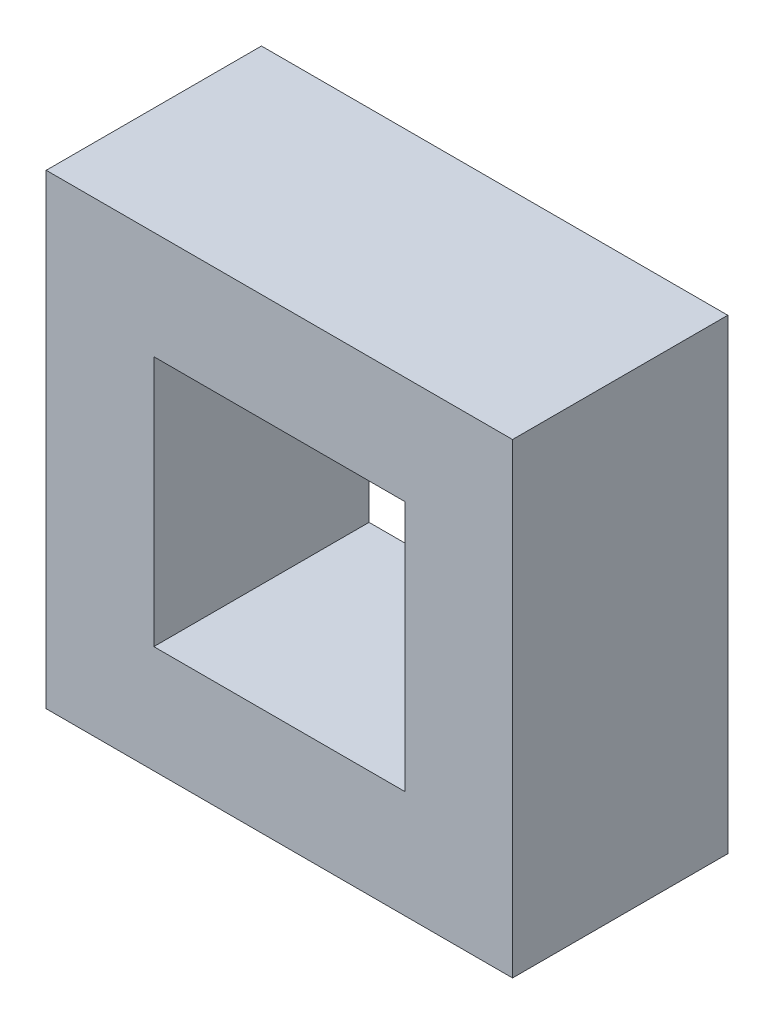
from build123d import *

# Parameters (mm, degrees)
SKETCH2_W      = 660.4
SKETCH2_H      = 660.4
SKETCH2_W_2    = 355.6
SKETCH2_H_2    = 355.6
EXTRUDE1_DEPTH = 304.8


with BuildPart() as part:
    # Sketch2 → Extrude1 (new body)
    with BuildSketch(Plane.XY):
        Rectangle(SKETCH2_W, SKETCH2_H)
        Rectangle(SKETCH2_W_2, SKETCH2_H_2, mode=Mode.SUBTRACT)
    extrude(amount=EXTRUDE1_DEPTH)


solid = part.part
